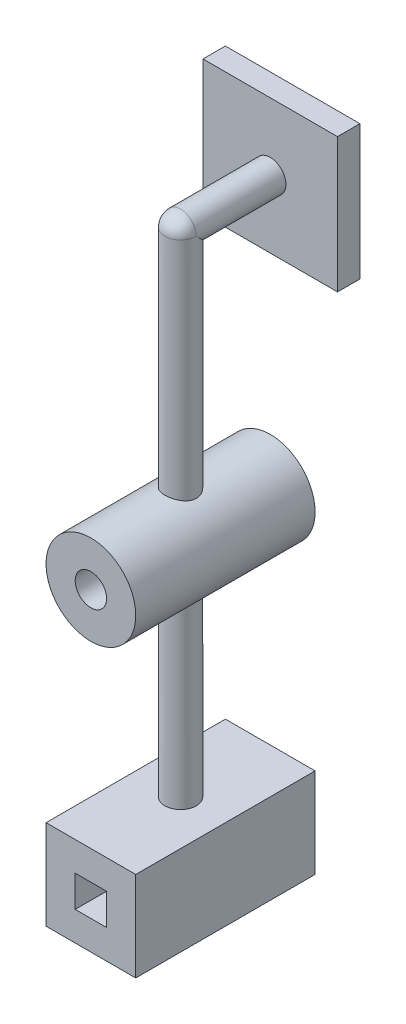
ISO-10303-21;
HEADER;
FILE_DESCRIPTION(('STEP AP214'),'2;1');
FILE_NAME('part.step','',(''),(''),'','','');
FILE_SCHEMA(('AUTOMOTIVE_DESIGN { 1 0 10303 214 1 1 1 1 }'));
ENDSEC;
DATA;
#1=APPLICATION_CONTEXT('core data for automotive mechanical design processes');
#2=APPLICATION_PROTOCOL_DEFINITION('international standard','automotive_design',2000,#1);
#3=PRODUCT_CONTEXT('',#1,'mechanical');
#4=PRODUCT('Part','Part','',(#3));
#5=PRODUCT_RELATED_PRODUCT_CATEGORY('part','',(#4));
#6=PRODUCT_DEFINITION_FORMATION('','',#4);
#7=PRODUCT_DEFINITION_CONTEXT('part definition',#1,'design');
#8=PRODUCT_DEFINITION('design','',#6,#7);
#9=PRODUCT_DEFINITION_SHAPE('','',#8);
#10=(LENGTH_UNIT() NAMED_UNIT(*) SI_UNIT(.MILLI.,.METRE.));
#11=(NAMED_UNIT(*) PLANE_ANGLE_UNIT() SI_UNIT($,.RADIAN.));
#12=(NAMED_UNIT(*) SI_UNIT($,.STERADIAN.) SOLID_ANGLE_UNIT());
#13=UNCERTAINTY_MEASURE_WITH_UNIT(LENGTH_MEASURE(1.E-05),#10,'distance_accuracy_value','');
#14=(GEOMETRIC_REPRESENTATION_CONTEXT(3) GLOBAL_UNCERTAINTY_ASSIGNED_CONTEXT((#13)) GLOBAL_UNIT_ASSIGNED_CONTEXT((#10,
#11,#12)) REPRESENTATION_CONTEXT('',''));
#15=CARTESIAN_POINT('',(0.,0.,0.));
#16=DIRECTION('',(0.,0.,1.));
#17=DIRECTION('',(1.,0.,0.));
#18=AXIS2_PLACEMENT_3D('',#15,#16,#17);
#19=CARTESIAN_POINT('',(0.,0.,20.));
#20=DIRECTION('',(0.,0.,-1.));
#21=DIRECTION('',(-1.,0.,0.));
#22=AXIS2_PLACEMENT_3D('',#19,#20,#21);
#23=CYLINDRICAL_SURFACE('',#22,10.);
#24=CARTESIAN_POINT('',(0.,-10.,3.5));
#25=CARTESIAN_POINT('',(0.190419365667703,-10.000002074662,3.5000029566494));
#26=CARTESIAN_POINT('',(0.380817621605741,-9.99451197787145,3.48441032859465));
#27=CARTESIAN_POINT('',(0.755973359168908,-9.97315454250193,3.42266620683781));
#28=CARTESIAN_POINT('',(0.940730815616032,-9.95728715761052,3.37651457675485));
#29=CARTESIAN_POINT('',(1.29914235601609,-9.91689126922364,3.25545106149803));
#30=CARTESIAN_POINT('',(1.47281549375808,-9.89237812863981,3.18059017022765));
#31=CARTESIAN_POINT('',(1.80513664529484,-9.83716899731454,3.00447488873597));
#32=CARTESIAN_POINT('',(1.96378123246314,-9.80647160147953,2.90321449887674));
#33=CARTESIAN_POINT('',(2.26752589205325,-9.74080617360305,2.67317148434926));
#34=CARTESIAN_POINT('',(2.41198196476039,-9.70572841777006,2.54357008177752));
#35=CARTESIAN_POINT('',(2.67761185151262,-9.6358339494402,2.26226333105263));
#36=CARTESIAN_POINT('',(2.79877980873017,-9.60101730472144,2.11055243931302));
#37=CARTESIAN_POINT('',(3.01822956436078,-9.53435354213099,1.78334535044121));
#38=CARTESIAN_POINT('',(3.11564633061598,-9.50263856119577,1.60723944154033));
#39=CARTESIAN_POINT('',(3.27919932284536,-9.44745244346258,1.23985540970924));
#40=CARTESIAN_POINT('',(3.34534622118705,-9.42397849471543,1.04858248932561));
#41=CARTESIAN_POINT('',(3.442016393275,-9.3890943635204,0.663656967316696));
#42=CARTESIAN_POINT('',(3.47375567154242,-9.37727382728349,0.470348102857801));
#43=CARTESIAN_POINT('',(3.5045119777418,-9.36582571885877,0.0808148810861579));
#44=CARTESIAN_POINT('',(3.50354037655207,-9.36619390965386,-0.115408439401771));
#45=CARTESIAN_POINT('',(3.4698409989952,-9.37872426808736,-0.494549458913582));
#46=CARTESIAN_POINT('',(3.43873715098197,-9.3902833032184,-0.677634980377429));
#47=CARTESIAN_POINT('',(3.34831908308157,-9.42290004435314,-1.03580240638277));
#48=CARTESIAN_POINT('',(3.28900115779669,-9.44395899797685,-1.21088325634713));
#49=CARTESIAN_POINT('',(3.14284371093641,-9.49360610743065,-1.55161236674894));
#50=CARTESIAN_POINT('',(3.05554665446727,-9.52231799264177,-1.71704555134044));
#51=CARTESIAN_POINT('',(2.85622688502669,-9.58398812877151,-2.03141194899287));
#52=CARTESIAN_POINT('',(2.74419646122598,-9.61694770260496,-2.18033999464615));
#53=CARTESIAN_POINT('',(2.49093399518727,-9.68573241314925,-2.46654322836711));
#54=CARTESIAN_POINT('',(2.34838607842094,-9.72161293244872,-2.60264324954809));
#55=CARTESIAN_POINT('',(2.04205684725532,-9.79053740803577,-2.84932987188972));
#56=CARTESIAN_POINT('',(1.87827306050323,-9.8235810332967,-2.95991349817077));
#57=CARTESIAN_POINT('',(1.53143472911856,-9.88362313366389,-3.15350599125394));
#58=CARTESIAN_POINT('',(1.34817380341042,-9.91054487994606,-3.2361705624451));
#59=CARTESIAN_POINT('',(0.969175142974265,-9.95474882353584,-3.36912230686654));
#60=CARTESIAN_POINT('',(0.773442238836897,-9.97203472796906,-3.41942193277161));
#61=CARTESIAN_POINT('',(0.384982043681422,-9.9943906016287,-3.48406581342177));
#62=CARTESIAN_POINT('',(0.192549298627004,-9.99999889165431,-3.49999580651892));
#63=CARTESIAN_POINT('',(-0.192296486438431,-10.0000011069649,-3.50000418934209));
#64=CARTESIAN_POINT('',(-0.384709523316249,-9.99439714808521,-3.48408858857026));
#65=CARTESIAN_POINT('',(-0.75751229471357,-9.972960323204,-3.42209465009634));
#66=CARTESIAN_POINT('',(-0.93808952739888,-9.95746630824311,-3.37701486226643));
#67=CARTESIAN_POINT('',(-1.28902504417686,-9.91814590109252,-3.25924618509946));
#68=CARTESIAN_POINT('',(-1.45938200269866,-9.89431843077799,-3.18655372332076));
#69=CARTESIAN_POINT('',(-1.790306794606,-9.8399042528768,-3.01340991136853));
#70=CARTESIAN_POINT('',(-1.95047324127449,-9.80914873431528,-2.91224601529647));
#71=CARTESIAN_POINT('',(-2.25205778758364,-9.74433517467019,-2.68585482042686));
#72=CARTESIAN_POINT('',(-2.39346963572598,-9.71027603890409,-2.56061953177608));
#73=CARTESIAN_POINT('',(-2.66095315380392,-9.64050839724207,-2.28219979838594));
#74=CARTESIAN_POINT('',(-2.78589451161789,-9.60480315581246,-2.12792589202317));
#75=CARTESIAN_POINT('',(-3.00828742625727,-9.53749178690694,-1.79985410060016));
#76=CARTESIAN_POINT('',(-3.10573801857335,-9.50588580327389,-1.62605553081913));
#77=CARTESIAN_POINT('',(-3.27010981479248,-9.45060554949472,-1.26333270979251));
#78=CARTESIAN_POINT('',(-3.33703039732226,-9.42693144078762,-1.07440815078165));
#79=CARTESIAN_POINT('',(-3.43775166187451,-9.39067542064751,-0.686934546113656));
#80=CARTESIAN_POINT('',(-3.47156933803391,-9.37808781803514,-0.488390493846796));
#81=CARTESIAN_POINT('',(-3.50371939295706,-9.36612061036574,-0.0993796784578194));
#82=CARTESIAN_POINT('',(-3.50394730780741,-9.36603546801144,0.0909102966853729));
#83=CARTESIAN_POINT('',(-3.47365100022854,-9.37731326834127,0.468662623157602));
#84=CARTESIAN_POINT('',(-3.44312898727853,-9.38867538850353,0.656125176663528));
#85=CARTESIAN_POINT('',(-3.35359653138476,-9.42101694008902,1.01855095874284));
#86=CARTESIAN_POINT('',(-3.29526105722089,-9.44176794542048,1.19370296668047));
#87=CARTESIAN_POINT('',(-3.15232119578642,-9.49044489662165,1.53185809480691));
#88=CARTESIAN_POINT('',(-3.06771062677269,-9.51837253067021,1.69485834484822));
#89=CARTESIAN_POINT('',(-2.86997020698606,-9.57989875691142,2.0124345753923));
#90=CARTESIAN_POINT('',(-2.75568240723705,-9.61370284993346,2.16624940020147));
#91=CARTESIAN_POINT('',(-2.50372401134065,-9.68237561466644,2.45312762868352));
#92=CARTESIAN_POINT('',(-2.36604648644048,-9.71724459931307,2.58618486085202));
#93=CARTESIAN_POINT('',(-2.0638531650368,-9.78598669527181,2.83378378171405));
#94=CARTESIAN_POINT('',(-1.89841397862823,-9.81974595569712,2.94723445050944));
#95=CARTESIAN_POINT('',(-1.54966762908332,-9.8807802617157,3.14462349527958));
#96=CARTESIAN_POINT('',(-1.36636283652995,-9.90805616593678,3.22856577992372));
#97=CARTESIAN_POINT('',(-0.9890298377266,-9.95276281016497,3.36325721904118));
#98=CARTESIAN_POINT('',(-0.79513954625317,-9.97029715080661,3.41435660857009));
#99=CARTESIAN_POINT('',(-0.400823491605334,-9.9939126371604,3.48272048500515));
#100=CARTESIAN_POINT('',(-0.20040005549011,-9.9999978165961,3.49999688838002));
#101=CARTESIAN_POINT('',(0.,-10.,3.5));
#102=B_SPLINE_CURVE_WITH_KNOTS('',3,(#24,#25,#26,#27,#28,#29,#30,#31,#32,#33,#34,#35,#36,#37,
#38,#39,#40,#41,#42,#43,#44,#45,#46,#47,#48,#49,#50,#51,#52,#53,#54,#55,#56,#57,#58,#59,#60,#61,
#62,#63,#64,#65,#66,#67,#68,#69,#70,#71,#72,#73,#74,#75,#76,#77,#78,#79,#80,#81,#82,#83,#84,#85,
#86,#87,#88,#89,#90,#91,#92,#93,#94,#95,#96,#97,#98,#99,#100,#101),.UNSPECIFIED.,.T.,.F.,(4,2,2,
2,2,2,2,2,2,2,2,2,2,2,2,2,2,2,2,2,2,2,2,2,2,2,2,2,2,2,2,2,2,2,2,2,2,2,4),(0.,0.570519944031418,
1.14104243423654,1.71055621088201,2.28019953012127,2.86921290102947,3.45837421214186,
4.06655384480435,4.67452575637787,5.26023033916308,5.84573132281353,6.40133800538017,
6.95701767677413,7.5222923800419,8.08774356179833,8.68595781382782,9.28424177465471,
9.88965514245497,10.4948354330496,11.0714375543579,11.6479308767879,12.2056613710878,
12.7634640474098,13.336703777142,13.9101341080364,14.5124257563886,15.1147385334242,
15.7170635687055,16.319079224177,16.8871081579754,17.4550962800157,18.0099524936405,
18.5649393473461,19.1461307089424,19.7274945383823,20.3347978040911,20.9420205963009,
21.5426555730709,22.143078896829),.UNSPECIFIED.);
#103=CARTESIAN_POINT('',(0.,-10.,3.5));
#104=VERTEX_POINT('',#103);
#105=EDGE_CURVE('E188',#104,#104,#102,.T.);
#106=ORIENTED_EDGE('',*,*,#105,.T.);
#107=EDGE_LOOP('',(#106));
#108=FACE_BOUND('',#107,.T.);
#109=CARTESIAN_POINT('',(0.,0.,-20.));
#110=DIRECTION('',(0.,0.,1.));
#111=DIRECTION('',(1.,0.,0.));
#112=AXIS2_PLACEMENT_3D('',#109,#110,#111);
#113=CIRCLE('',#112,10.);
#114=CARTESIAN_POINT('',(10.,0.,-20.));
#115=VERTEX_POINT('',#114);
#116=EDGE_CURVE('E257',#115,#115,#113,.T.);
#117=ORIENTED_EDGE('',*,*,#116,.T.);
#118=EDGE_LOOP('',(#117));
#119=FACE_BOUND('',#118,.T.);
#120=CARTESIAN_POINT('',(0.,0.,20.));
#121=DIRECTION('',(0.,0.,1.));
#122=DIRECTION('',(1.,0.,0.));
#123=AXIS2_PLACEMENT_3D('',#120,#121,#122);
#124=CIRCLE('',#123,10.);
#125=CARTESIAN_POINT('',(10.,0.,20.));
#126=VERTEX_POINT('',#125);
#127=EDGE_CURVE('E251',#126,#126,#124,.T.);
#128=ORIENTED_EDGE('',*,*,#127,.F.);
#129=EDGE_LOOP('',(#128));
#130=FACE_BOUND('',#129,.T.);
#131=CARTESIAN_POINT('',(0.,10.,-3.5));
#132=CARTESIAN_POINT('',(-0.190419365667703,10.000002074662,-3.5000029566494));
#133=CARTESIAN_POINT('',(-0.380817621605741,9.99451197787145,-3.48441032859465));
#134=CARTESIAN_POINT('',(-0.755973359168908,9.97315454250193,-3.42266620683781));
#135=CARTESIAN_POINT('',(-0.940730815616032,9.95728715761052,-3.37651457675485));
#136=CARTESIAN_POINT('',(-1.29914235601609,9.91689126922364,-3.25545106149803));
#137=CARTESIAN_POINT('',(-1.47281549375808,9.89237812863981,-3.18059017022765));
#138=CARTESIAN_POINT('',(-1.80513664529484,9.83716899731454,-3.00447488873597));
#139=CARTESIAN_POINT('',(-1.96378123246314,9.80647160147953,-2.90321449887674));
#140=CARTESIAN_POINT('',(-2.26752589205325,9.74080617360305,-2.67317148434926));
#141=CARTESIAN_POINT('',(-2.41198196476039,9.70572841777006,-2.54357008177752));
#142=CARTESIAN_POINT('',(-2.67761185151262,9.6358339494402,-2.26226333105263));
#143=CARTESIAN_POINT('',(-2.79877980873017,9.60101730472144,-2.11055243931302));
#144=CARTESIAN_POINT('',(-3.01822956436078,9.53435354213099,-1.78334535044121));
#145=CARTESIAN_POINT('',(-3.11564633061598,9.50263856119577,-1.60723944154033));
#146=CARTESIAN_POINT('',(-3.27919932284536,9.44745244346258,-1.23985540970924));
#147=CARTESIAN_POINT('',(-3.34534622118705,9.42397849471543,-1.04858248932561));
#148=CARTESIAN_POINT('',(-3.442016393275,9.3890943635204,-0.663656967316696));
#149=CARTESIAN_POINT('',(-3.47375567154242,9.37727382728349,-0.470348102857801));
#150=CARTESIAN_POINT('',(-3.5045119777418,9.36582571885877,-0.0808148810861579));
#151=CARTESIAN_POINT('',(-3.50354037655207,9.36619390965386,0.115408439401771));
#152=CARTESIAN_POINT('',(-3.4698409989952,9.37872426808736,0.494549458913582));
#153=CARTESIAN_POINT('',(-3.43873715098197,9.3902833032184,0.677634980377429));
#154=CARTESIAN_POINT('',(-3.34831908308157,9.42290004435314,1.03580240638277));
#155=CARTESIAN_POINT('',(-3.28900115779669,9.44395899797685,1.21088325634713));
#156=CARTESIAN_POINT('',(-3.14284371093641,9.49360610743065,1.55161236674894));
#157=CARTESIAN_POINT('',(-3.05554665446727,9.52231799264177,1.71704555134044));
#158=CARTESIAN_POINT('',(-2.85622688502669,9.58398812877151,2.03141194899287));
#159=CARTESIAN_POINT('',(-2.74419646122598,9.61694770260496,2.18033999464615));
#160=CARTESIAN_POINT('',(-2.49093399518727,9.68573241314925,2.46654322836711));
#161=CARTESIAN_POINT('',(-2.34838607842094,9.72161293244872,2.60264324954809));
#162=CARTESIAN_POINT('',(-2.04205684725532,9.79053740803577,2.84932987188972));
#163=CARTESIAN_POINT('',(-1.87827306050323,9.8235810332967,2.95991349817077));
#164=CARTESIAN_POINT('',(-1.53143472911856,9.88362313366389,3.15350599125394));
#165=CARTESIAN_POINT('',(-1.34817380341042,9.91054487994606,3.2361705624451));
#166=CARTESIAN_POINT('',(-0.969175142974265,9.95474882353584,3.36912230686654));
#167=CARTESIAN_POINT('',(-0.773442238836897,9.97203472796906,3.41942193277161));
#168=CARTESIAN_POINT('',(-0.384982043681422,9.9943906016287,3.48406581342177));
#169=CARTESIAN_POINT('',(-0.192549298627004,9.99999889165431,3.49999580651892));
#170=CARTESIAN_POINT('',(0.192296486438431,10.0000011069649,3.50000418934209));
#171=CARTESIAN_POINT('',(0.384709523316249,9.99439714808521,3.48408858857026));
#172=CARTESIAN_POINT('',(0.75751229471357,9.972960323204,3.42209465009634));
#173=CARTESIAN_POINT('',(0.93808952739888,9.95746630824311,3.37701486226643));
#174=CARTESIAN_POINT('',(1.28902504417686,9.91814590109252,3.25924618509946));
#175=CARTESIAN_POINT('',(1.45938200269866,9.89431843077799,3.18655372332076));
#176=CARTESIAN_POINT('',(1.790306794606,9.8399042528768,3.01340991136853));
#177=CARTESIAN_POINT('',(1.95047324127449,9.80914873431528,2.91224601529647));
#178=CARTESIAN_POINT('',(2.25205778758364,9.74433517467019,2.68585482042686));
#179=CARTESIAN_POINT('',(2.39346963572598,9.71027603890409,2.56061953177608));
#180=CARTESIAN_POINT('',(2.66095315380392,9.64050839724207,2.28219979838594));
#181=CARTESIAN_POINT('',(2.78589451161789,9.60480315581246,2.12792589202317));
#182=CARTESIAN_POINT('',(3.00828742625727,9.53749178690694,1.79985410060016));
#183=CARTESIAN_POINT('',(3.10573801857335,9.50588580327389,1.62605553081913));
#184=CARTESIAN_POINT('',(3.27010981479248,9.45060554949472,1.26333270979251));
#185=CARTESIAN_POINT('',(3.33703039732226,9.42693144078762,1.07440815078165));
#186=CARTESIAN_POINT('',(3.43775166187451,9.39067542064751,0.686934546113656));
#187=CARTESIAN_POINT('',(3.47156933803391,9.37808781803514,0.488390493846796));
#188=CARTESIAN_POINT('',(3.50371939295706,9.36612061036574,0.0993796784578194));
#189=CARTESIAN_POINT('',(3.50394730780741,9.36603546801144,-0.0909102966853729));
#190=CARTESIAN_POINT('',(3.47365100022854,9.37731326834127,-0.468662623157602));
#191=CARTESIAN_POINT('',(3.44312898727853,9.38867538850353,-0.656125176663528));
#192=CARTESIAN_POINT('',(3.35359653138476,9.42101694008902,-1.01855095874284));
#193=CARTESIAN_POINT('',(3.29526105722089,9.44176794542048,-1.19370296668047));
#194=CARTESIAN_POINT('',(3.15232119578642,9.49044489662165,-1.53185809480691));
#195=CARTESIAN_POINT('',(3.06771062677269,9.51837253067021,-1.69485834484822));
#196=CARTESIAN_POINT('',(2.86997020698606,9.57989875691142,-2.0124345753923));
#197=CARTESIAN_POINT('',(2.75568240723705,9.61370284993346,-2.16624940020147));
#198=CARTESIAN_POINT('',(2.50372401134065,9.68237561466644,-2.45312762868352));
#199=CARTESIAN_POINT('',(2.36604648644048,9.71724459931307,-2.58618486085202));
#200=CARTESIAN_POINT('',(2.0638531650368,9.78598669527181,-2.83378378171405));
#201=CARTESIAN_POINT('',(1.89841397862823,9.81974595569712,-2.94723445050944));
#202=CARTESIAN_POINT('',(1.54966762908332,9.8807802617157,-3.14462349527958));
#203=CARTESIAN_POINT('',(1.36636283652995,9.90805616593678,-3.22856577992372));
#204=CARTESIAN_POINT('',(0.9890298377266,9.95276281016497,-3.36325721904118));
#205=CARTESIAN_POINT('',(0.79513954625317,9.97029715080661,-3.41435660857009));
#206=CARTESIAN_POINT('',(0.400823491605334,9.9939126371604,-3.48272048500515));
#207=CARTESIAN_POINT('',(0.20040005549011,9.9999978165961,-3.49999688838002));
#208=CARTESIAN_POINT('',(0.,10.,-3.5));
#209=B_SPLINE_CURVE_WITH_KNOTS('',3,(#131,#132,#133,#134,#135,#136,#137,#138,#139,#140,#141,
#142,#143,#144,#145,#146,#147,#148,#149,#150,#151,#152,#153,#154,#155,#156,#157,#158,#159,#160,
#161,#162,#163,#164,#165,#166,#167,#168,#169,#170,#171,#172,#173,#174,#175,#176,#177,#178,#179,
#180,#181,#182,#183,#184,#185,#186,#187,#188,#189,#190,#191,#192,#193,#194,#195,#196,#197,#198,
#199,#200,#201,#202,#203,#204,#205,#206,#207,#208),.UNSPECIFIED.,.T.,.F.,(4,2,2,2,2,2,2,2,2,2,2,
2,2,2,2,2,2,2,2,2,2,2,2,2,2,2,2,2,2,2,2,2,2,2,2,2,2,2,4),(0.,0.570519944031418,1.14104243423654,
1.71055621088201,2.28019953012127,2.86921290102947,3.45837421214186,4.06655384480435,
4.67452575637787,5.26023033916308,5.84573132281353,6.40133800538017,6.95701767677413,
7.5222923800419,8.08774356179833,8.68595781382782,9.28424177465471,9.88965514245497,
10.4948354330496,11.0714375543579,11.6479308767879,12.2056613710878,12.7634640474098,
13.336703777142,13.9101341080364,14.5124257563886,15.1147385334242,15.7170635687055,
16.319079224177,16.8871081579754,17.4550962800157,18.0099524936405,18.5649393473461,
19.1461307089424,19.7274945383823,20.3347978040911,20.9420205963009,21.5426555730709,
22.143078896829),.UNSPECIFIED.);
#210=CARTESIAN_POINT('',(0.,10.,-3.5));
#211=VERTEX_POINT('',#210);
#212=EDGE_CURVE('E244',#211,#211,#209,.T.);
#213=ORIENTED_EDGE('',*,*,#212,.F.);
#214=EDGE_LOOP('',(#213));
#215=FACE_BOUND('',#214,.T.);
#216=ADVANCED_FACE('F32',(#108,#119,#130,#215),#23,.T.);
#217=CARTESIAN_POINT('',(0.,0.,20.));
#218=DIRECTION('',(0.,0.,-1.));
#219=DIRECTION('',(-1.,0.,0.));
#220=AXIS2_PLACEMENT_3D('',#217,#218,#219);
#221=CYLINDRICAL_SURFACE('',#220,3.5);
#222=CARTESIAN_POINT('',(0.,0.,-20.));
#223=DIRECTION('',(0.,0.,1.));
#224=DIRECTION('',(1.,0.,0.));
#225=AXIS2_PLACEMENT_3D('',#222,#223,#224);
#226=CIRCLE('',#225,3.5);
#227=CARTESIAN_POINT('',(3.5,0.,-20.));
#228=VERTEX_POINT('',#227);
#229=EDGE_CURVE('E254',#228,#228,#226,.T.);
#230=ORIENTED_EDGE('',*,*,#229,.F.);
#231=EDGE_LOOP('',(#230));
#232=FACE_BOUND('',#231,.T.);
#233=CARTESIAN_POINT('',(0.,0.,20.));
#234=DIRECTION('',(0.,0.,1.));
#235=DIRECTION('',(1.,0.,0.));
#236=AXIS2_PLACEMENT_3D('',#233,#234,#235);
#237=CIRCLE('',#236,3.5);
#238=CARTESIAN_POINT('',(3.5,0.,20.));
#239=VERTEX_POINT('',#238);
#240=EDGE_CURVE('E260',#239,#239,#237,.T.);
#241=ORIENTED_EDGE('',*,*,#240,.T.);
#242=EDGE_LOOP('',(#241));
#243=FACE_BOUND('',#242,.T.);
#244=ADVANCED_FACE('F287',(#232,#243),#221,.F.);
#245=CARTESIAN_POINT('',(0.,0.,20.));
#246=DIRECTION('',(0.,0.,1.));
#247=DIRECTION('',(1.,0.,0.));
#248=AXIS2_PLACEMENT_3D('',#245,#246,#247);
#249=PLANE('',#248);
#250=ORIENTED_EDGE('',*,*,#127,.T.);
#251=EDGE_LOOP('',(#250));
#252=FACE_BOUND('',#251,.T.);
#253=ORIENTED_EDGE('',*,*,#240,.F.);
#254=EDGE_LOOP('',(#253));
#255=FACE_BOUND('',#254,.T.);
#256=ADVANCED_FACE('F292',(#252,#255),#249,.T.);
#257=CARTESIAN_POINT('',(0.,0.,-20.));
#258=DIRECTION('',(0.,0.,1.));
#259=DIRECTION('',(1.,0.,0.));
#260=AXIS2_PLACEMENT_3D('',#257,#258,#259);
#261=PLANE('',#260);
#262=ORIENTED_EDGE('',*,*,#229,.T.);
#263=EDGE_LOOP('',(#262));
#264=FACE_BOUND('',#263,.T.);
#265=ORIENTED_EDGE('',*,*,#116,.F.);
#266=EDGE_LOOP('',(#265));
#267=FACE_BOUND('',#266,.T.);
#268=ADVANCED_FACE('F240',(#264,#267),#261,.F.);
#269=CARTESIAN_POINT('',(0.,60.,0.));
#270=DIRECTION('',(0.,-1.,0.));
#271=DIRECTION('',(0.,0.,-1.));
#272=AXIS2_PLACEMENT_3D('',#269,#270,#271);
#273=CYLINDRICAL_SURFACE('',#272,3.5);
#274=CARTESIAN_POINT('',(0.,60.,0.));
#275=DIRECTION('',(0.,1.,0.));
#276=DIRECTION('',(0.,0.,1.));
#277=AXIS2_PLACEMENT_3D('',#274,#275,#276);
#278=CIRCLE('',#277,3.5);
#279=CARTESIAN_POINT('',(-3.5,60.,0.));
#280=VERTEX_POINT('',#279);
#281=CARTESIAN_POINT('',(3.5,60.,0.));
#282=VERTEX_POINT('',#281);
#283=EDGE_CURVE('E252',#280,#282,#278,.T.);
#284=ORIENTED_EDGE('',*,*,#283,.F.);
#285=CARTESIAN_POINT('',(0.,60.,0.));
#286=DIRECTION('',(0.,-0.707106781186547,0.707106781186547));
#287=DIRECTION('',(0.,-0.707106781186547,-0.707106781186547));
#288=AXIS2_PLACEMENT_3D('',#285,#286,#287);
#289=ELLIPSE('',#288,4.94974746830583,3.5);
#290=EDGE_CURVE('E486',#280,#282,#289,.T.);
#291=ORIENTED_EDGE('',*,*,#290,.T.);
#292=EDGE_LOOP('',(#284,#291));
#293=FACE_BOUND('',#292,.T.);
#294=ORIENTED_EDGE('',*,*,#212,.T.);
#295=EDGE_LOOP('',(#294));
#296=FACE_BOUND('',#295,.T.);
#297=ADVANCED_FACE('F235',(#293,#296),#273,.T.);
#298=CARTESIAN_POINT('',(0.,60.,-20.));
#299=DIRECTION('',(0.,0.,1.));
#300=DIRECTION('',(1.,0.,0.));
#301=AXIS2_PLACEMENT_3D('',#298,#299,#300);
#302=CYLINDRICAL_SURFACE('',#301,3.5);
#303=CARTESIAN_POINT('',(0.,60.,-20.));
#304=DIRECTION('',(0.,0.,-1.));
#305=DIRECTION('',(-1.,0.,0.));
#306=AXIS2_PLACEMENT_3D('',#303,#304,#305);
#307=CIRCLE('',#306,3.5);
#308=CARTESIAN_POINT('',(-3.5,60.,-20.));
#309=VERTEX_POINT('',#308);
#310=EDGE_CURVE('E491',#309,#309,#307,.F.);
#311=ORIENTED_EDGE('',*,*,#310,.T.);
#312=EDGE_LOOP('',(#311));
#313=FACE_BOUND('',#312,.T.);
#314=ORIENTED_EDGE('',*,*,#290,.F.);
#315=CARTESIAN_POINT('',(0.,60.,0.));
#316=DIRECTION('',(0.,0.,1.));
#317=DIRECTION('',(1.,0.,0.));
#318=AXIS2_PLACEMENT_3D('',#315,#316,#317);
#319=CIRCLE('',#318,3.5);
#320=EDGE_CURVE('E489',#282,#280,#319,.T.);
#321=ORIENTED_EDGE('',*,*,#320,.F.);
#322=EDGE_LOOP('',(#314,#321));
#323=FACE_BOUND('',#322,.T.);
#324=ADVANCED_FACE('F231',(#313,#323),#302,.T.);
#325=CARTESIAN_POINT('',(0.,60.,0.));
#326=DIRECTION('',(0.,1.,0.));
#327=DIRECTION('',(0.,0.,-1.));
#328=AXIS2_PLACEMENT_3D('',#325,#326,#327);
#329=SPHERICAL_SURFACE('',#328,3.5);
#330=ORIENTED_EDGE('',*,*,#320,.T.);
#331=ORIENTED_EDGE('',*,*,#283,.T.);
#332=EDGE_LOOP('',(#330,#331));
#333=FACE_BOUND('',#332,.T.);
#334=ADVANCED_FACE('F227',(#333),#329,.T.);
#335=CARTESIAN_POINT('',(15.,75.,-25.));
#336=DIRECTION('',(-1.,0.,0.));
#337=DIRECTION('',(0.,-1.,0.));
#338=AXIS2_PLACEMENT_3D('',#335,#336,#337);
#339=PLANE('',#338);
#340=DIRECTION('',(0.,-1.,0.));
#341=VECTOR('',#340,1.);
#342=CARTESIAN_POINT('',(15.,75.,-20.));
#343=LINE('',#342,#341);
#344=CARTESIAN_POINT('',(15.,75.,-20.));
#345=VERTEX_POINT('',#344);
#346=CARTESIAN_POINT('',(15.,45.,-20.));
#347=VERTEX_POINT('',#346);
#348=EDGE_CURVE('E194',#345,#347,#343,.T.);
#349=ORIENTED_EDGE('',*,*,#348,.T.);
#350=DIRECTION('',(0.,0.,1.));
#351=VECTOR('',#350,1.);
#352=CARTESIAN_POINT('',(15.,45.,-25.));
#353=LINE('',#352,#351);
#354=CARTESIAN_POINT('',(15.,45.,-25.));
#355=VERTEX_POINT('',#354);
#356=EDGE_CURVE('E496',#355,#347,#353,.T.);
#357=ORIENTED_EDGE('',*,*,#356,.F.);
#358=DIRECTION('',(0.,-1.,0.));
#359=VECTOR('',#358,1.);
#360=CARTESIAN_POINT('',(15.,75.,-25.));
#361=LINE('',#360,#359);
#362=CARTESIAN_POINT('',(15.,75.,-25.));
#363=VERTEX_POINT('',#362);
#364=EDGE_CURVE('E514',#363,#355,#361,.T.);
#365=ORIENTED_EDGE('',*,*,#364,.F.);
#366=DIRECTION('',(0.,0.,1.));
#367=VECTOR('',#366,1.);
#368=CARTESIAN_POINT('',(15.,75.,-25.));
#369=LINE('',#368,#367);
#370=EDGE_CURVE('E505',#363,#345,#369,.T.);
#371=ORIENTED_EDGE('',*,*,#370,.T.);
#372=EDGE_LOOP('',(#349,#357,#365,#371));
#373=FACE_BOUND('',#372,.T.);
#374=ADVANCED_FACE('F223',(#373),#339,.F.);
#375=CARTESIAN_POINT('',(15.,45.,-25.));
#376=DIRECTION('',(0.,1.,0.));
#377=DIRECTION('',(0.,0.,1.));
#378=AXIS2_PLACEMENT_3D('',#375,#376,#377);
#379=PLANE('',#378);
#380=DIRECTION('',(-1.,0.,0.));
#381=VECTOR('',#380,1.);
#382=CARTESIAN_POINT('',(15.,45.,-20.));
#383=LINE('',#382,#381);
#384=CARTESIAN_POINT('',(-15.,45.,-20.));
#385=VERTEX_POINT('',#384);
#386=EDGE_CURVE('E520',#347,#385,#383,.T.);
#387=ORIENTED_EDGE('',*,*,#386,.T.);
#388=DIRECTION('',(0.,0.,1.));
#389=VECTOR('',#388,1.);
#390=CARTESIAN_POINT('',(-15.,45.,-25.));
#391=LINE('',#390,#389);
#392=CARTESIAN_POINT('',(-15.,45.,-25.));
#393=VERTEX_POINT('',#392);
#394=EDGE_CURVE('E499',#393,#385,#391,.T.);
#395=ORIENTED_EDGE('',*,*,#394,.F.);
#396=DIRECTION('',(-1.,0.,0.));
#397=VECTOR('',#396,1.);
#398=CARTESIAN_POINT('',(15.,45.,-25.));
#399=LINE('',#398,#397);
#400=EDGE_CURVE('E512',#355,#393,#399,.T.);
#401=ORIENTED_EDGE('',*,*,#400,.F.);
#402=ORIENTED_EDGE('',*,*,#356,.T.);
#403=EDGE_LOOP('',(#387,#395,#401,#402));
#404=FACE_BOUND('',#403,.T.);
#405=ADVANCED_FACE('F219',(#404),#379,.F.);
#406=CARTESIAN_POINT('',(-15.,75.,-25.));
#407=DIRECTION('',(1.,0.,0.));
#408=DIRECTION('',(0.,1.,0.));
#409=AXIS2_PLACEMENT_3D('',#406,#407,#408);
#410=PLANE('',#409);
#411=DIRECTION('',(0.,1.,0.));
#412=VECTOR('',#411,1.);
#413=CARTESIAN_POINT('',(-15.,75.,-20.));
#414=LINE('',#413,#412);
#415=CARTESIAN_POINT('',(-15.,75.,-20.));
#416=VERTEX_POINT('',#415);
#417=EDGE_CURVE('E519',#385,#416,#414,.T.);
#418=ORIENTED_EDGE('',*,*,#417,.T.);
#419=DIRECTION('',(0.,0.,1.));
#420=VECTOR('',#419,1.);
#421=CARTESIAN_POINT('',(-15.,75.,-25.));
#422=LINE('',#421,#420);
#423=CARTESIAN_POINT('',(-15.,75.,-25.));
#424=VERTEX_POINT('',#423);
#425=EDGE_CURVE('E502',#424,#416,#422,.T.);
#426=ORIENTED_EDGE('',*,*,#425,.F.);
#427=DIRECTION('',(0.,1.,0.));
#428=VECTOR('',#427,1.);
#429=CARTESIAN_POINT('',(-15.,75.,-25.));
#430=LINE('',#429,#428);
#431=EDGE_CURVE('E510',#393,#424,#430,.T.);
#432=ORIENTED_EDGE('',*,*,#431,.F.);
#433=ORIENTED_EDGE('',*,*,#394,.T.);
#434=EDGE_LOOP('',(#418,#426,#432,#433));
#435=FACE_BOUND('',#434,.T.);
#436=ADVANCED_FACE('F215',(#435),#410,.F.);
#437=CARTESIAN_POINT('',(15.,75.,-25.));
#438=DIRECTION('',(0.,-1.,0.));
#439=DIRECTION('',(0.,0.,-1.));
#440=AXIS2_PLACEMENT_3D('',#437,#438,#439);
#441=PLANE('',#440);
#442=DIRECTION('',(1.,0.,0.));
#443=VECTOR('',#442,1.);
#444=CARTESIAN_POINT('',(15.,75.,-20.));
#445=LINE('',#444,#443);
#446=EDGE_CURVE('E517',#416,#345,#445,.T.);
#447=ORIENTED_EDGE('',*,*,#446,.T.);
#448=ORIENTED_EDGE('',*,*,#370,.F.);
#449=DIRECTION('',(1.,0.,0.));
#450=VECTOR('',#449,1.);
#451=CARTESIAN_POINT('',(15.,75.,-25.));
#452=LINE('',#451,#450);
#453=EDGE_CURVE('E508',#424,#363,#452,.T.);
#454=ORIENTED_EDGE('',*,*,#453,.F.);
#455=ORIENTED_EDGE('',*,*,#425,.T.);
#456=EDGE_LOOP('',(#447,#448,#454,#455));
#457=FACE_BOUND('',#456,.T.);
#458=ADVANCED_FACE('F211',(#457),#441,.F.);
#459=CARTESIAN_POINT('',(15.,45.,-25.));
#460=DIRECTION('',(0.,0.,-1.));
#461=DIRECTION('',(-1.,0.,0.));
#462=AXIS2_PLACEMENT_3D('',#459,#460,#461);
#463=PLANE('',#462);
#464=ORIENTED_EDGE('',*,*,#364,.T.);
#465=ORIENTED_EDGE('',*,*,#400,.T.);
#466=ORIENTED_EDGE('',*,*,#431,.T.);
#467=ORIENTED_EDGE('',*,*,#453,.T.);
#468=EDGE_LOOP('',(#464,#465,#466,#467));
#469=FACE_BOUND('',#468,.T.);
#470=ADVANCED_FACE('F207',(#469),#463,.T.);
#471=CARTESIAN_POINT('',(15.,45.,-20.));
#472=DIRECTION('',(0.,0.,-1.));
#473=DIRECTION('',(-1.,0.,0.));
#474=AXIS2_PLACEMENT_3D('',#471,#472,#473);
#475=PLANE('',#474);
#476=ORIENTED_EDGE('',*,*,#310,.F.);
#477=EDGE_LOOP('',(#476));
#478=FACE_BOUND('',#477,.T.);
#479=ORIENTED_EDGE('',*,*,#348,.F.);
#480=ORIENTED_EDGE('',*,*,#446,.F.);
#481=ORIENTED_EDGE('',*,*,#417,.F.);
#482=ORIENTED_EDGE('',*,*,#386,.F.);
#483=EDGE_LOOP('',(#479,#480,#481,#482));
#484=FACE_BOUND('',#483,.T.);
#485=ADVANCED_FACE('F202',(#478,#484),#475,.F.);
#486=CARTESIAN_POINT('',(0.,-50.,0.));
#487=DIRECTION('',(0.,1.,0.));
#488=DIRECTION('',(0.,0.,1.));
#489=AXIS2_PLACEMENT_3D('',#486,#487,#488);
#490=CYLINDRICAL_SURFACE('',#489,3.5);
#491=CARTESIAN_POINT('',(0.,-50.,0.));
#492=DIRECTION('',(0.,1.,0.));
#493=DIRECTION('',(0.,0.,1.));
#494=AXIS2_PLACEMENT_3D('',#491,#492,#493);
#495=CIRCLE('',#494,3.5);
#496=CARTESIAN_POINT('',(0.,-50.,3.5));
#497=VERTEX_POINT('',#496);
#498=EDGE_CURVE('E185',#497,#497,#495,.F.);
#499=ORIENTED_EDGE('',*,*,#498,.F.);
#500=EDGE_LOOP('',(#499));
#501=FACE_BOUND('',#500,.T.);
#502=ORIENTED_EDGE('',*,*,#105,.F.);
#503=EDGE_LOOP('',(#502));
#504=FACE_BOUND('',#503,.T.);
#505=ADVANCED_FACE('F196',(#501,#504),#490,.T.);
#506=CARTESIAN_POINT('',(9.99999999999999,-70.,20.));
#507=DIRECTION('',(-1.,0.,0.));
#508=DIRECTION('',(0.,0.,1.));
#509=AXIS2_PLACEMENT_3D('',#506,#507,#508);
#510=PLANE('',#509);
#511=DIRECTION('',(0.,0.,1.));
#512=VECTOR('',#511,1.);
#513=CARTESIAN_POINT('',(9.99999999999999,-50.,20.));
#514=LINE('',#513,#512);
#515=CARTESIAN_POINT('',(10.,-50.,-20.));
#516=VERTEX_POINT('',#515);
#517=CARTESIAN_POINT('',(9.99999999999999,-50.,20.));
#518=VERTEX_POINT('',#517);
#519=EDGE_CURVE('E153',#516,#518,#514,.T.);
#520=ORIENTED_EDGE('',*,*,#519,.T.);
#521=DIRECTION('',(0.,1.,0.));
#522=VECTOR('',#521,1.);
#523=CARTESIAN_POINT('',(9.99999999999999,-70.,20.));
#524=LINE('',#523,#522);
#525=CARTESIAN_POINT('',(9.99999999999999,-70.,20.));
#526=VERTEX_POINT('',#525);
#527=EDGE_CURVE('E182',#526,#518,#524,.T.);
#528=ORIENTED_EDGE('',*,*,#527,.F.);
#529=DIRECTION('',(0.,0.,1.));
#530=VECTOR('',#529,1.);
#531=CARTESIAN_POINT('',(9.99999999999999,-70.,20.));
#532=LINE('',#531,#530);
#533=CARTESIAN_POINT('',(10.,-70.,-20.));
#534=VERTEX_POINT('',#533);
#535=EDGE_CURVE('E164',#534,#526,#532,.T.);
#536=ORIENTED_EDGE('',*,*,#535,.F.);
#537=DIRECTION('',(0.,1.,0.));
#538=VECTOR('',#537,1.);
#539=CARTESIAN_POINT('',(10.,-70.,-20.));
#540=LINE('',#539,#538);
#541=EDGE_CURVE('E173',#534,#516,#540,.T.);
#542=ORIENTED_EDGE('',*,*,#541,.T.);
#543=EDGE_LOOP('',(#520,#528,#536,#542));
#544=FACE_BOUND('',#543,.T.);
#545=ADVANCED_FACE('F201',(#544),#510,.F.);
#546=CARTESIAN_POINT('',(9.99999999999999,-70.,20.));
#547=DIRECTION('',(0.,0.,-1.));
#548=DIRECTION('',(-1.,0.,0.));
#549=AXIS2_PLACEMENT_3D('',#546,#547,#548);
#550=PLANE('',#549);
#551=DIRECTION('',(1.,0.,0.));
#552=VECTOR('',#551,1.);
#553=CARTESIAN_POINT('',(-3.50000000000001,-63.5,20.));
#554=LINE('',#553,#552);
#555=CARTESIAN_POINT('',(-3.50000000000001,-63.5,20.));
#556=VERTEX_POINT('',#555);
#557=CARTESIAN_POINT('',(3.49999999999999,-63.5,20.));
#558=VERTEX_POINT('',#557);
#559=EDGE_CURVE('E139',#556,#558,#554,.T.);
#560=ORIENTED_EDGE('',*,*,#559,.F.);
#561=DIRECTION('',(0.,-1.,0.));
#562=VECTOR('',#561,1.);
#563=CARTESIAN_POINT('',(-3.50000000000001,-56.5,20.));
#564=LINE('',#563,#562);
#565=CARTESIAN_POINT('',(-3.50000000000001,-56.5,20.));
#566=VERTEX_POINT('',#565);
#567=EDGE_CURVE('E47',#566,#556,#564,.T.);
#568=ORIENTED_EDGE('',*,*,#567,.F.);
#569=DIRECTION('',(-1.,0.,0.));
#570=VECTOR('',#569,1.);
#571=CARTESIAN_POINT('',(-3.50000000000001,-56.5,20.));
#572=LINE('',#571,#570);
#573=CARTESIAN_POINT('',(3.49999999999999,-56.5,20.));
#574=VERTEX_POINT('',#573);
#575=EDGE_CURVE('E146',#574,#566,#572,.T.);
#576=ORIENTED_EDGE('',*,*,#575,.F.);
#577=DIRECTION('',(0.,1.,0.));
#578=VECTOR('',#577,1.);
#579=CARTESIAN_POINT('',(3.49999999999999,-56.5,20.));
#580=LINE('',#579,#578);
#581=EDGE_CURVE('E130',#558,#574,#580,.T.);
#582=ORIENTED_EDGE('',*,*,#581,.F.);
#583=EDGE_LOOP('',(#560,#568,#576,#582));
#584=FACE_BOUND('',#583,.T.);
#585=DIRECTION('',(-1.,0.,0.));
#586=VECTOR('',#585,1.);
#587=CARTESIAN_POINT('',(9.99999999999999,-50.,20.));
#588=LINE('',#587,#586);
#589=CARTESIAN_POINT('',(-10.,-50.,20.));
#590=VERTEX_POINT('',#589);
#591=EDGE_CURVE('E158',#518,#590,#588,.T.);
#592=ORIENTED_EDGE('',*,*,#591,.T.);
#593=DIRECTION('',(0.,1.,0.));
#594=VECTOR('',#593,1.);
#595=CARTESIAN_POINT('',(-10.,-70.,20.));
#596=LINE('',#595,#594);
#597=CARTESIAN_POINT('',(-10.,-70.,20.));
#598=VERTEX_POINT('',#597);
#599=EDGE_CURVE('E179',#598,#590,#596,.T.);
#600=ORIENTED_EDGE('',*,*,#599,.F.);
#601=DIRECTION('',(-1.,0.,0.));
#602=VECTOR('',#601,1.);
#603=CARTESIAN_POINT('',(9.99999999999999,-70.,20.));
#604=LINE('',#603,#602);
#605=EDGE_CURVE('E167',#526,#598,#604,.T.);
#606=ORIENTED_EDGE('',*,*,#605,.F.);
#607=ORIENTED_EDGE('',*,*,#527,.T.);
#608=EDGE_LOOP('',(#592,#600,#606,#607));
#609=FACE_BOUND('',#608,.T.);
#610=ADVANCED_FACE('F143',(#584,#609),#550,.F.);
#611=CARTESIAN_POINT('',(-10.,-70.,20.));
#612=DIRECTION('',(1.,0.,0.));
#613=DIRECTION('',(0.,0.,-1.));
#614=AXIS2_PLACEMENT_3D('',#611,#612,#613);
#615=PLANE('',#614);
#616=DIRECTION('',(0.,0.,-1.));
#617=VECTOR('',#616,1.);
#618=CARTESIAN_POINT('',(-10.,-50.,20.));
#619=LINE('',#618,#617);
#620=CARTESIAN_POINT('',(-10.,-50.,-20.));
#621=VERTEX_POINT('',#620);
#622=EDGE_CURVE('E160',#590,#621,#619,.T.);
#623=ORIENTED_EDGE('',*,*,#622,.T.);
#624=DIRECTION('',(0.,1.,0.));
#625=VECTOR('',#624,1.);
#626=CARTESIAN_POINT('',(-10.,-70.,-20.));
#627=LINE('',#626,#625);
#628=CARTESIAN_POINT('',(-10.,-70.,-20.));
#629=VERTEX_POINT('',#628);
#630=EDGE_CURVE('E176',#629,#621,#627,.T.);
#631=ORIENTED_EDGE('',*,*,#630,.F.);
#632=DIRECTION('',(0.,0.,-1.));
#633=VECTOR('',#632,1.);
#634=CARTESIAN_POINT('',(-10.,-70.,20.));
#635=LINE('',#634,#633);
#636=EDGE_CURVE('E169',#598,#629,#635,.T.);
#637=ORIENTED_EDGE('',*,*,#636,.F.);
#638=ORIENTED_EDGE('',*,*,#599,.T.);
#639=EDGE_LOOP('',(#623,#631,#637,#638));
#640=FACE_BOUND('',#639,.T.);
#641=ADVANCED_FACE('F368',(#640),#615,.F.);
#642=CARTESIAN_POINT('',(10.,-70.,-20.));
#643=DIRECTION('',(0.,0.,1.));
#644=DIRECTION('',(1.,0.,0.));
#645=AXIS2_PLACEMENT_3D('',#642,#643,#644);
#646=PLANE('',#645);
#647=DIRECTION('',(-1.,0.,0.));
#648=VECTOR('',#647,1.);
#649=CARTESIAN_POINT('',(10.,-56.5,-20.));
#650=LINE('',#649,#648);
#651=CARTESIAN_POINT('',(3.49999999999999,-56.5,-20.));
#652=VERTEX_POINT('',#651);
#653=CARTESIAN_POINT('',(-3.50000000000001,-56.5,-20.));
#654=VERTEX_POINT('',#653);
#655=EDGE_CURVE('E40',#652,#654,#650,.T.);
#656=ORIENTED_EDGE('',*,*,#655,.T.);
#657=DIRECTION('',(0.,-1.,0.));
#658=VECTOR('',#657,1.);
#659=CARTESIAN_POINT('',(-3.50000000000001,-70.,-20.));
#660=LINE('',#659,#658);
#661=CARTESIAN_POINT('',(-3.50000000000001,-63.5,-20.));
#662=VERTEX_POINT('',#661);
#663=EDGE_CURVE('E11',#654,#662,#660,.T.);
#664=ORIENTED_EDGE('',*,*,#663,.T.);
#665=DIRECTION('',(1.,0.,0.));
#666=VECTOR('',#665,1.);
#667=CARTESIAN_POINT('',(10.,-63.5,-20.));
#668=LINE('',#667,#666);
#669=CARTESIAN_POINT('',(3.49999999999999,-63.5,-20.));
#670=VERTEX_POINT('',#669);
#671=EDGE_CURVE('E250',#662,#670,#668,.T.);
#672=ORIENTED_EDGE('',*,*,#671,.T.);
#673=DIRECTION('',(0.,1.,0.));
#674=VECTOR('',#673,1.);
#675=CARTESIAN_POINT('',(3.49999999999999,-70.,-20.));
#676=LINE('',#675,#674);
#677=EDGE_CURVE('E133',#670,#652,#676,.T.);
#678=ORIENTED_EDGE('',*,*,#677,.T.);
#679=EDGE_LOOP('',(#656,#664,#672,#678));
#680=FACE_BOUND('',#679,.T.);
#681=DIRECTION('',(1.,0.,0.));
#682=VECTOR('',#681,1.);
#683=CARTESIAN_POINT('',(10.,-50.,-20.));
#684=LINE('',#683,#682);
#685=EDGE_CURVE('E162',#621,#516,#684,.T.);
#686=ORIENTED_EDGE('',*,*,#685,.T.);
#687=ORIENTED_EDGE('',*,*,#541,.F.);
#688=DIRECTION('',(1.,0.,0.));
#689=VECTOR('',#688,1.);
#690=CARTESIAN_POINT('',(10.,-70.,-20.));
#691=LINE('',#690,#689);
#692=EDGE_CURVE('E171',#629,#534,#691,.T.);
#693=ORIENTED_EDGE('',*,*,#692,.F.);
#694=ORIENTED_EDGE('',*,*,#630,.T.);
#695=EDGE_LOOP('',(#686,#687,#693,#694));
#696=FACE_BOUND('',#695,.T.);
#697=ADVANCED_FACE('F268',(#680,#696),#646,.F.);
#698=CARTESIAN_POINT('',(9.99999999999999,-70.,20.));
#699=DIRECTION('',(0.,1.,0.));
#700=DIRECTION('',(0.,0.,1.));
#701=AXIS2_PLACEMENT_3D('',#698,#699,#700);
#702=PLANE('',#701);
#703=ORIENTED_EDGE('',*,*,#535,.T.);
#704=ORIENTED_EDGE('',*,*,#605,.T.);
#705=ORIENTED_EDGE('',*,*,#636,.T.);
#706=ORIENTED_EDGE('',*,*,#692,.T.);
#707=EDGE_LOOP('',(#703,#704,#705,#706));
#708=FACE_BOUND('',#707,.T.);
#709=ADVANCED_FACE('F282',(#708),#702,.F.);
#710=CARTESIAN_POINT('',(9.99999999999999,-50.,20.));
#711=DIRECTION('',(0.,1.,0.));
#712=DIRECTION('',(0.,0.,1.));
#713=AXIS2_PLACEMENT_3D('',#710,#711,#712);
#714=PLANE('',#713);
#715=ORIENTED_EDGE('',*,*,#498,.T.);
#716=EDGE_LOOP('',(#715));
#717=FACE_BOUND('',#716,.T.);
#718=ORIENTED_EDGE('',*,*,#519,.F.);
#719=ORIENTED_EDGE('',*,*,#685,.F.);
#720=ORIENTED_EDGE('',*,*,#622,.F.);
#721=ORIENTED_EDGE('',*,*,#591,.F.);
#722=EDGE_LOOP('',(#718,#719,#720,#721));
#723=FACE_BOUND('',#722,.T.);
#724=ADVANCED_FACE('F275',(#717,#723),#714,.T.);
#725=CARTESIAN_POINT('',(-3.50000000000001,-56.5,-25.));
#726=DIRECTION('',(-1.,0.,0.));
#727=DIRECTION('',(0.,-1.,0.));
#728=AXIS2_PLACEMENT_3D('',#725,#726,#727);
#729=PLANE('',#728);
#730=DIRECTION('',(0.,0.,1.));
#731=VECTOR('',#730,1.);
#732=CARTESIAN_POINT('',(-3.50000000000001,-56.5,-25.));
#733=LINE('',#732,#731);
#734=EDGE_CURVE('E151',#654,#566,#733,.T.);
#735=ORIENTED_EDGE('',*,*,#734,.T.);
#736=ORIENTED_EDGE('',*,*,#567,.T.);
#737=DIRECTION('',(0.,0.,1.));
#738=VECTOR('',#737,1.);
#739=CARTESIAN_POINT('',(-3.50000000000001,-63.5,-25.));
#740=LINE('',#739,#738);
#741=EDGE_CURVE('E136',#662,#556,#740,.T.);
#742=ORIENTED_EDGE('',*,*,#741,.F.);
#743=ORIENTED_EDGE('',*,*,#663,.F.);
#744=EDGE_LOOP('',(#735,#736,#742,#743));
#745=FACE_BOUND('',#744,.T.);
#746=ADVANCED_FACE('F273',(#745),#729,.F.);
#747=CARTESIAN_POINT('',(-3.50000000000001,-56.5,-25.));
#748=DIRECTION('',(0.,1.,0.));
#749=DIRECTION('',(0.,0.,1.));
#750=AXIS2_PLACEMENT_3D('',#747,#748,#749);
#751=PLANE('',#750);
#752=DIRECTION('',(0.,0.,1.));
#753=VECTOR('',#752,1.);
#754=CARTESIAN_POINT('',(3.49999999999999,-56.5,-25.));
#755=LINE('',#754,#753);
#756=EDGE_CURVE('E135',#652,#574,#755,.T.);
#757=ORIENTED_EDGE('',*,*,#756,.T.);
#758=ORIENTED_EDGE('',*,*,#575,.T.);
#759=ORIENTED_EDGE('',*,*,#734,.F.);
#760=ORIENTED_EDGE('',*,*,#655,.F.);
#761=EDGE_LOOP('',(#757,#758,#759,#760));
#762=FACE_BOUND('',#761,.T.);
#763=ADVANCED_FACE('F272',(#762),#751,.F.);
#764=CARTESIAN_POINT('',(3.49999999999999,-56.5,-25.));
#765=DIRECTION('',(1.,0.,0.));
#766=DIRECTION('',(0.,1.,0.));
#767=AXIS2_PLACEMENT_3D('',#764,#765,#766);
#768=PLANE('',#767);
#769=DIRECTION('',(0.,0.,1.));
#770=VECTOR('',#769,1.);
#771=CARTESIAN_POINT('',(3.49999999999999,-63.5,-25.));
#772=LINE('',#771,#770);
#773=EDGE_CURVE('E55',#670,#558,#772,.T.);
#774=ORIENTED_EDGE('',*,*,#773,.T.);
#775=ORIENTED_EDGE('',*,*,#581,.T.);
#776=ORIENTED_EDGE('',*,*,#756,.F.);
#777=ORIENTED_EDGE('',*,*,#677,.F.);
#778=EDGE_LOOP('',(#774,#775,#776,#777));
#779=FACE_BOUND('',#778,.T.);
#780=ADVANCED_FACE('F127',(#779),#768,.F.);
#781=CARTESIAN_POINT('',(-3.50000000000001,-63.5,-25.));
#782=DIRECTION('',(0.,-1.,0.));
#783=DIRECTION('',(0.,0.,-1.));
#784=AXIS2_PLACEMENT_3D('',#781,#782,#783);
#785=PLANE('',#784);
#786=ORIENTED_EDGE('',*,*,#741,.T.);
#787=ORIENTED_EDGE('',*,*,#559,.T.);
#788=ORIENTED_EDGE('',*,*,#773,.F.);
#789=ORIENTED_EDGE('',*,*,#671,.F.);
#790=EDGE_LOOP('',(#786,#787,#788,#789));
#791=FACE_BOUND('',#790,.T.);
#792=ADVANCED_FACE('F140',(#791),#785,.F.);
#793=CLOSED_SHELL('',(#216,#244,#256,#268,#297,#324,#334,#374,#405,#436,#458,#470,#485,#505,
#545,#610,#641,#697,#709,#724,#746,#763,#780,#792));
#794=MANIFOLD_SOLID_BREP('B2',#793);
#795=ADVANCED_BREP_SHAPE_REPRESENTATION('',(#18,#794),#14);
#796=SHAPE_DEFINITION_REPRESENTATION(#9,#795);
ENDSEC;
END-ISO-10303-21;
